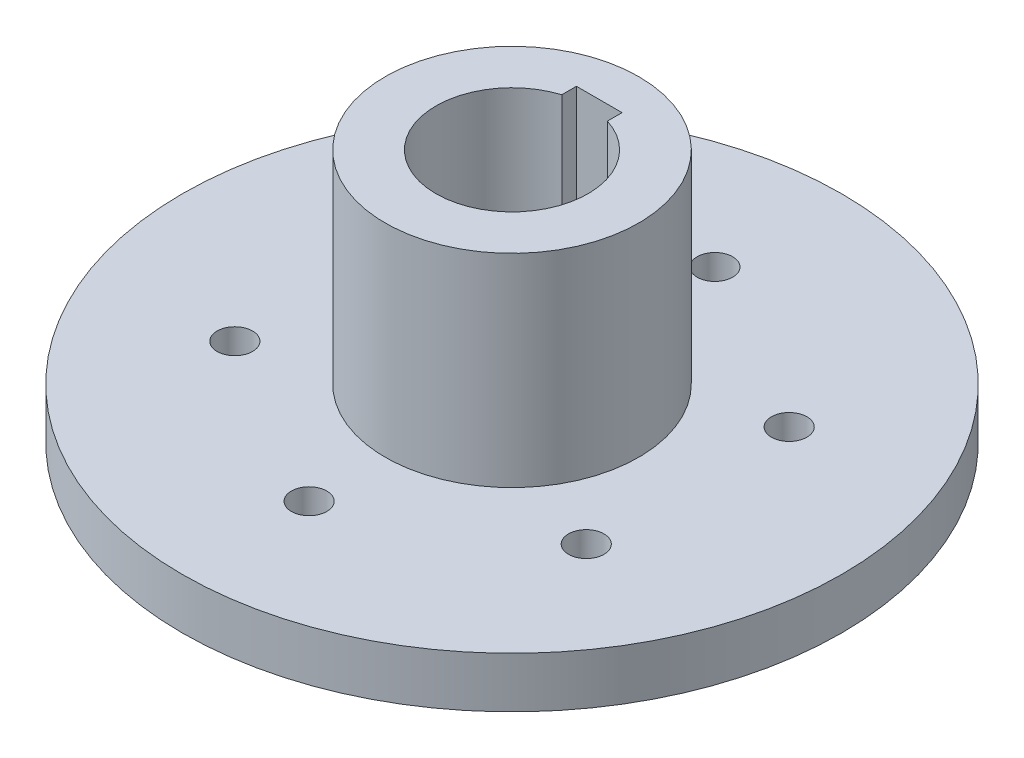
from build123d import *

# Parameters (mm, degrees)
SKETCH2_R          = 7
SKETCH2_W          = 18
SKETCH2_H          = 11
CUT_EXTRUDE1_DEPTH = 230.128784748


with BuildPart() as part:
    # Sketch1 → Revolve1 (revolve)
    with BuildSketch(Plane.XY, mode=Mode.PRIVATE) as revolve1_sk:
        Polygon((0, 0), (0, 100), (20, 100), (20, 20), (100, 20), (100, 0), align=None)
    revolve(revolve1_sk.sketch.rotate(Axis((-30, -0.140675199, 0), (0, 1, 0)), 90), axis=Axis((-30, -0.140675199, 0), (0, 1, 0)))

    # Sketch2 → Cut-Extrude1 (cut, through all)
    with BuildSketch(Plane(origin=(0, 100, 0), x_dir=(1, 0, 0), z_dir=(0, 1, 0))):
        with Locations(Location((-30, 80, 0), (0, 0, 270))):
            Circle(SKETCH2_R)
        with Locations(Location((39.282032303, 40, 0), (0, 0, 270))):
            Circle(SKETCH2_R)
        with Locations(Location((39.282032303, -40, 0), (0, 0, 270))):
            Circle(SKETCH2_R)
        with Locations(Location((-30, -80, 0), (0, 0, 270))):
            Circle(SKETCH2_R)
        with Locations(Location((-99.282032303, -40, 0), (0, 0, 270))):
            Circle(SKETCH2_R)
        with Locations(Location((-99.282032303, 40, 0), (0, 0, 270))):
            Circle(SKETCH2_R)
        with Locations((-30, 28.9)):
            Rectangle(SKETCH2_W, SKETCH2_H)
    extrude(amount=-CUT_EXTRUDE1_DEPTH, mode=Mode.SUBTRACT)


solid = part.part
